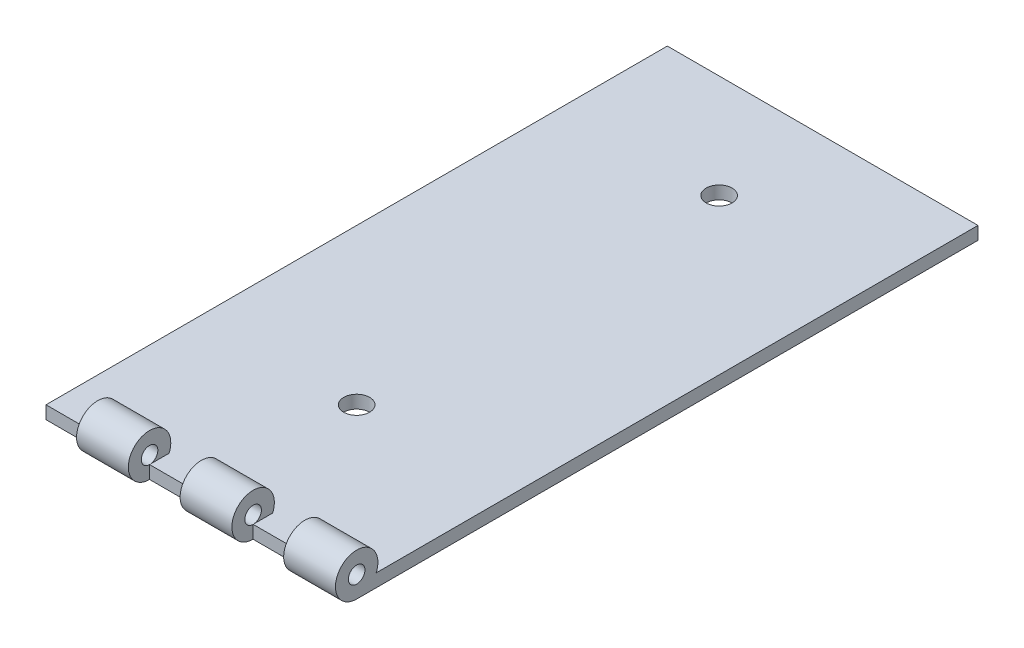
ISO-10303-21;
HEADER;
FILE_DESCRIPTION(('STEP AP214'),'2;1');
FILE_NAME('part.step','',(''),(''),'','','');
FILE_SCHEMA(('AUTOMOTIVE_DESIGN { 1 0 10303 214 1 1 1 1 }'));
ENDSEC;
DATA;
#1=APPLICATION_CONTEXT('core data for automotive mechanical design processes');
#2=APPLICATION_PROTOCOL_DEFINITION('international standard','automotive_design',2000,#1);
#3=PRODUCT_CONTEXT('',#1,'mechanical');
#4=PRODUCT('Part','Part','',(#3));
#5=PRODUCT_RELATED_PRODUCT_CATEGORY('part','',(#4));
#6=PRODUCT_DEFINITION_FORMATION('','',#4);
#7=PRODUCT_DEFINITION_CONTEXT('part definition',#1,'design');
#8=PRODUCT_DEFINITION('design','',#6,#7);
#9=PRODUCT_DEFINITION_SHAPE('','',#8);
#10=(LENGTH_UNIT() NAMED_UNIT(*) SI_UNIT(.MILLI.,.METRE.));
#11=(NAMED_UNIT(*) PLANE_ANGLE_UNIT() SI_UNIT($,.RADIAN.));
#12=(NAMED_UNIT(*) SI_UNIT($,.STERADIAN.) SOLID_ANGLE_UNIT());
#13=UNCERTAINTY_MEASURE_WITH_UNIT(LENGTH_MEASURE(1.E-05),#10,'distance_accuracy_value','');
#14=(GEOMETRIC_REPRESENTATION_CONTEXT(3) GLOBAL_UNCERTAINTY_ASSIGNED_CONTEXT((#13)) GLOBAL_UNIT_ASSIGNED_CONTEXT((#10,
#11,#12)) REPRESENTATION_CONTEXT('',''));
#15=CARTESIAN_POINT('',(0.,0.,0.));
#16=DIRECTION('',(0.,0.,1.));
#17=DIRECTION('',(1.,0.,0.));
#18=AXIS2_PLACEMENT_3D('',#15,#16,#17);
#19=CARTESIAN_POINT('',(-19.05,1.5875,38.1));
#20=DIRECTION('',(0.,0.,-1.));
#21=DIRECTION('',(-1.,0.,0.));
#22=AXIS2_PLACEMENT_3D('',#19,#20,#21);
#23=PLANE('',#22);
#24=DIRECTION('',(0.,-1.,0.));
#25=VECTOR('',#24,1.);
#26=CARTESIAN_POINT('',(-12.7,1.5875,38.1));
#27=LINE('',#26,#25);
#28=CARTESIAN_POINT('',(-12.7,1.5875,38.1));
#29=VERTEX_POINT('',#28);
#30=CARTESIAN_POINT('',(-12.7,0.,38.1));
#31=VERTEX_POINT('',#30);
#32=EDGE_CURVE('E161',#29,#31,#27,.T.);
#33=ORIENTED_EDGE('',*,*,#32,.F.);
#34=DIRECTION('',(1.,0.,0.));
#35=VECTOR('',#34,1.);
#36=CARTESIAN_POINT('',(-19.05,1.5875,38.1));
#37=LINE('',#36,#35);
#38=CARTESIAN_POINT('',(-19.05,1.5875,38.1));
#39=VERTEX_POINT('',#38);
#40=EDGE_CURVE('E217',#39,#29,#37,.T.);
#41=ORIENTED_EDGE('',*,*,#40,.F.);
#42=DIRECTION('',(0.,-1.,0.));
#43=VECTOR('',#42,1.);
#44=CARTESIAN_POINT('',(-19.05,1.5875,38.1));
#45=LINE('',#44,#43);
#46=CARTESIAN_POINT('',(-19.05,0.,38.1));
#47=VERTEX_POINT('',#46);
#48=EDGE_CURVE('E219',#39,#47,#45,.T.);
#49=ORIENTED_EDGE('',*,*,#48,.T.);
#50=DIRECTION('',(1.,0.,0.));
#51=VECTOR('',#50,1.);
#52=CARTESIAN_POINT('',(-19.05,0.,38.1));
#53=LINE('',#52,#51);
#54=EDGE_CURVE('E130',#47,#31,#53,.T.);
#55=ORIENTED_EDGE('',*,*,#54,.T.);
#56=EDGE_LOOP('',(#33,#41,#49,#55));
#57=FACE_BOUND('',#56,.T.);
#58=ADVANCED_FACE('F33',(#57),#23,.F.);
#59=CARTESIAN_POINT('',(0.,1.5875,0.));
#60=DIRECTION('',(0.,-1.,0.));
#61=DIRECTION('',(0.,0.,-1.));
#62=AXIS2_PLACEMENT_3D('',#59,#60,#61);
#63=PLANE('',#62);
#64=CARTESIAN_POINT('',(0.,1.5875,19.05));
#65=DIRECTION('',(0.,-1.,0.));
#66=DIRECTION('',(0.,0.,-1.));
#67=AXIS2_PLACEMENT_3D('',#64,#65,#66);
#68=CIRCLE('',#67,1.5875);
#69=CARTESIAN_POINT('',(0.,1.5875,20.6375));
#70=VERTEX_POINT('',#69);
#71=EDGE_CURVE('E462',#70,#70,#68,.T.);
#72=ORIENTED_EDGE('',*,*,#71,.T.);
#73=EDGE_LOOP('',(#72));
#74=FACE_BOUND('',#73,.T.);
#75=CARTESIAN_POINT('',(0.,1.5875,-25.4));
#76=DIRECTION('',(0.,-1.,0.));
#77=DIRECTION('',(0.,0.,-1.));
#78=AXIS2_PLACEMENT_3D('',#75,#76,#77);
#79=CIRCLE('',#78,1.5875);
#80=CARTESIAN_POINT('',(0.,1.5875,-23.8125));
#81=VERTEX_POINT('',#80);
#82=EDGE_CURVE('E466',#81,#81,#79,.T.);
#83=ORIENTED_EDGE('',*,*,#82,.T.);
#84=EDGE_LOOP('',(#83));
#85=FACE_BOUND('',#84,.T.);
#86=DIRECTION('',(0.,0.,1.));
#87=VECTOR('',#86,1.);
#88=CARTESIAN_POINT('',(-12.7,1.5875,0.));
#89=LINE('',#88,#87);
#90=CARTESIAN_POINT('',(-12.7,1.5875,35.7029275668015));
#91=VERTEX_POINT('',#90);
#92=EDGE_CURVE('E48',#91,#29,#89,.T.);
#93=ORIENTED_EDGE('',*,*,#92,.F.);
#94=DIRECTION('',(1.,0.,0.));
#95=VECTOR('',#94,1.);
#96=CARTESIAN_POINT('',(-12.7,1.5875,35.7029275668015));
#97=LINE('',#96,#95);
#98=CARTESIAN_POINT('',(-6.35,1.5875,35.7029275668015));
#99=VERTEX_POINT('',#98);
#100=EDGE_CURVE('E52',#91,#99,#97,.T.);
#101=ORIENTED_EDGE('',*,*,#100,.T.);
#102=DIRECTION('',(0.,0.,1.));
#103=VECTOR('',#102,1.);
#104=CARTESIAN_POINT('',(-6.35,1.5875,0.));
#105=LINE('',#104,#103);
#106=CARTESIAN_POINT('',(-6.35,1.5875,38.1));
#107=VERTEX_POINT('',#106);
#108=EDGE_CURVE('E140',#99,#107,#105,.T.);
#109=ORIENTED_EDGE('',*,*,#108,.T.);
#110=CARTESIAN_POINT('',(0.,1.5875,38.1));
#111=VERTEX_POINT('',#110);
#112=EDGE_CURVE('E135',#107,#111,#37,.T.);
#113=ORIENTED_EDGE('',*,*,#112,.T.);
#114=DIRECTION('',(0.,0.,1.));
#115=VECTOR('',#114,1.);
#116=CARTESIAN_POINT('',(0.,1.5875,0.));
#117=LINE('',#116,#115);
#118=CARTESIAN_POINT('',(0.,1.5875,35.7029275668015));
#119=VERTEX_POINT('',#118);
#120=EDGE_CURVE('E182',#119,#111,#117,.T.);
#121=ORIENTED_EDGE('',*,*,#120,.F.);
#122=DIRECTION('',(1.,0.,0.));
#123=VECTOR('',#122,1.);
#124=CARTESIAN_POINT('',(0.,1.5875,35.7029275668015));
#125=LINE('',#124,#123);
#126=CARTESIAN_POINT('',(6.35,1.5875,35.7029275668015));
#127=VERTEX_POINT('',#126);
#128=EDGE_CURVE('E187',#119,#127,#125,.T.);
#129=ORIENTED_EDGE('',*,*,#128,.T.);
#130=DIRECTION('',(0.,0.,1.));
#131=VECTOR('',#130,1.);
#132=CARTESIAN_POINT('',(6.35,1.5875,0.));
#133=LINE('',#132,#131);
#134=CARTESIAN_POINT('',(6.35,1.5875,38.1));
#135=VERTEX_POINT('',#134);
#136=EDGE_CURVE('E175',#127,#135,#133,.T.);
#137=ORIENTED_EDGE('',*,*,#136,.T.);
#138=CARTESIAN_POINT('',(12.7,1.5875,38.1));
#139=VERTEX_POINT('',#138);
#140=EDGE_CURVE('E216',#135,#139,#37,.T.);
#141=ORIENTED_EDGE('',*,*,#140,.T.);
#142=DIRECTION('',(0.,0.,1.));
#143=VECTOR('',#142,1.);
#144=CARTESIAN_POINT('',(12.7,1.5875,0.));
#145=LINE('',#144,#143);
#146=CARTESIAN_POINT('',(12.7,1.5875,35.7029275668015));
#147=VERTEX_POINT('',#146);
#148=EDGE_CURVE('E199',#147,#139,#145,.T.);
#149=ORIENTED_EDGE('',*,*,#148,.F.);
#150=DIRECTION('',(1.,0.,0.));
#151=VECTOR('',#150,1.);
#152=CARTESIAN_POINT('',(12.7,1.5875,35.7029275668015));
#153=LINE('',#152,#151);
#154=CARTESIAN_POINT('',(19.05,1.5875,35.7029275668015));
#155=VERTEX_POINT('',#154);
#156=EDGE_CURVE('E207',#147,#155,#153,.T.);
#157=ORIENTED_EDGE('',*,*,#156,.T.);
#158=DIRECTION('',(0.,0.,-1.));
#159=VECTOR('',#158,1.);
#160=CARTESIAN_POINT('',(19.05,1.5875,38.1));
#161=LINE('',#160,#159);
#162=CARTESIAN_POINT('',(19.05,1.5875,-38.1));
#163=VERTEX_POINT('',#162);
#164=EDGE_CURVE('E210',#155,#163,#161,.T.);
#165=ORIENTED_EDGE('',*,*,#164,.T.);
#166=DIRECTION('',(-1.,0.,0.));
#167=VECTOR('',#166,1.);
#168=CARTESIAN_POINT('',(-19.05,1.5875,-38.1));
#169=LINE('',#168,#167);
#170=CARTESIAN_POINT('',(-19.05,1.5875,-38.1));
#171=VERTEX_POINT('',#170);
#172=EDGE_CURVE('E212',#163,#171,#169,.T.);
#173=ORIENTED_EDGE('',*,*,#172,.T.);
#174=DIRECTION('',(0.,0.,1.));
#175=VECTOR('',#174,1.);
#176=CARTESIAN_POINT('',(-19.05,1.5875,38.1));
#177=LINE('',#176,#175);
#178=EDGE_CURVE('E214',#171,#39,#177,.T.);
#179=ORIENTED_EDGE('',*,*,#178,.T.);
#180=ORIENTED_EDGE('',*,*,#40,.T.);
#181=EDGE_LOOP('',(#93,#101,#109,#113,#121,#129,#137,#141,#149,#157,#165,#173,#179,#180));
#182=FACE_BOUND('',#181,.T.);
#183=ADVANCED_FACE('F258',(#74,#85,#182),#63,.F.);
#184=ORIENTED_EDGE('',*,*,#112,.F.);
#185=DIRECTION('',(0.,-1.,0.));
#186=VECTOR('',#185,1.);
#187=CARTESIAN_POINT('',(-6.35,1.5875,38.1));
#188=LINE('',#187,#186);
#189=CARTESIAN_POINT('',(-6.35,0.,38.1));
#190=VERTEX_POINT('',#189);
#191=EDGE_CURVE('E133',#107,#190,#188,.T.);
#192=ORIENTED_EDGE('',*,*,#191,.T.);
#193=CARTESIAN_POINT('',(0.,0.,38.1));
#194=VERTEX_POINT('',#193);
#195=EDGE_CURVE('E117',#190,#194,#53,.T.);
#196=ORIENTED_EDGE('',*,*,#195,.T.);
#197=DIRECTION('',(0.,-1.,0.));
#198=VECTOR('',#197,1.);
#199=CARTESIAN_POINT('',(0.,1.5875,38.1));
#200=LINE('',#199,#198);
#201=EDGE_CURVE('E185',#111,#194,#200,.T.);
#202=ORIENTED_EDGE('',*,*,#201,.F.);
#203=EDGE_LOOP('',(#184,#192,#196,#202));
#204=FACE_BOUND('',#203,.T.);
#205=ADVANCED_FACE('F134',(#204),#23,.F.);
#206=ORIENTED_EDGE('',*,*,#140,.F.);
#207=DIRECTION('',(0.,-1.,0.));
#208=VECTOR('',#207,1.);
#209=CARTESIAN_POINT('',(6.35,1.5875,38.1));
#210=LINE('',#209,#208);
#211=CARTESIAN_POINT('',(6.35,0.,38.1));
#212=VERTEX_POINT('',#211);
#213=EDGE_CURVE('E179',#135,#212,#210,.T.);
#214=ORIENTED_EDGE('',*,*,#213,.T.);
#215=CARTESIAN_POINT('',(12.7,0.,38.1));
#216=VERTEX_POINT('',#215);
#217=EDGE_CURVE('E149',#212,#216,#53,.T.);
#218=ORIENTED_EDGE('',*,*,#217,.T.);
#219=DIRECTION('',(0.,-1.,0.));
#220=VECTOR('',#219,1.);
#221=CARTESIAN_POINT('',(12.7,1.5875,38.1));
#222=LINE('',#221,#220);
#223=EDGE_CURVE('E204',#139,#216,#222,.T.);
#224=ORIENTED_EDGE('',*,*,#223,.F.);
#225=EDGE_LOOP('',(#206,#214,#218,#224));
#226=FACE_BOUND('',#225,.T.);
#227=ADVANCED_FACE('F260',(#226),#23,.F.);
#228=CARTESIAN_POINT('',(19.05,1.5875,38.1));
#229=DIRECTION('',(-1.,0.,0.));
#230=DIRECTION('',(0.,0.,1.));
#231=AXIS2_PLACEMENT_3D('',#228,#229,#230);
#232=PLANE('',#231);
#233=ORIENTED_EDGE('',*,*,#164,.F.);
#234=CARTESIAN_POINT('',(19.05,2.6035,38.1));
#235=DIRECTION('',(1.,0.,0.));
#236=DIRECTION('',(0.,0.,-1.));
#237=AXIS2_PLACEMENT_3D('',#234,#235,#236);
#238=CIRCLE('',#237,2.6035);
#239=CARTESIAN_POINT('',(19.05,0.,38.1));
#240=VERTEX_POINT('',#239);
#241=EDGE_CURVE('E193',#155,#240,#238,.T.);
#242=ORIENTED_EDGE('',*,*,#241,.T.);
#243=DIRECTION('',(0.,0.,-1.));
#244=VECTOR('',#243,1.);
#245=CARTESIAN_POINT('',(19.05,0.,38.1));
#246=LINE('',#245,#244);
#247=CARTESIAN_POINT('',(19.05,0.,-38.1));
#248=VERTEX_POINT('',#247);
#249=EDGE_CURVE('E209',#240,#248,#246,.T.);
#250=ORIENTED_EDGE('',*,*,#249,.T.);
#251=DIRECTION('',(0.,-1.,0.));
#252=VECTOR('',#251,1.);
#253=CARTESIAN_POINT('',(19.05,1.5875,-38.1));
#254=LINE('',#253,#252);
#255=EDGE_CURVE('E11',#163,#248,#254,.T.);
#256=ORIENTED_EDGE('',*,*,#255,.F.);
#257=EDGE_LOOP('',(#233,#242,#250,#256));
#258=FACE_BOUND('',#257,.T.);
#259=CARTESIAN_POINT('',(19.05,2.6035,38.1));
#260=DIRECTION('',(1.,0.,0.));
#261=DIRECTION('',(0.,0.,-1.));
#262=AXIS2_PLACEMENT_3D('',#259,#260,#261);
#263=CIRCLE('',#262,1.016);
#264=CARTESIAN_POINT('',(19.05,2.6035,37.084));
#265=VERTEX_POINT('',#264);
#266=EDGE_CURVE('E189',#265,#265,#263,.T.);
#267=ORIENTED_EDGE('',*,*,#266,.F.);
#268=EDGE_LOOP('',(#267));
#269=FACE_BOUND('',#268,.T.);
#270=ADVANCED_FACE('F35',(#258,#269),#232,.F.);
#271=CARTESIAN_POINT('',(-19.05,1.5875,-38.1));
#272=DIRECTION('',(0.,0.,1.));
#273=DIRECTION('',(1.,0.,0.));
#274=AXIS2_PLACEMENT_3D('',#271,#272,#273);
#275=PLANE('',#274);
#276=DIRECTION('',(-1.,0.,0.));
#277=VECTOR('',#276,1.);
#278=CARTESIAN_POINT('',(-19.05,0.,-38.1));
#279=LINE('',#278,#277);
#280=CARTESIAN_POINT('',(-19.05,0.,-38.1));
#281=VERTEX_POINT('',#280);
#282=EDGE_CURVE('E222',#248,#281,#279,.T.);
#283=ORIENTED_EDGE('',*,*,#282,.T.);
#284=DIRECTION('',(0.,-1.,0.));
#285=VECTOR('',#284,1.);
#286=CARTESIAN_POINT('',(-19.05,1.5875,-38.1));
#287=LINE('',#286,#285);
#288=EDGE_CURVE('E41',#171,#281,#287,.T.);
#289=ORIENTED_EDGE('',*,*,#288,.F.);
#290=ORIENTED_EDGE('',*,*,#172,.F.);
#291=ORIENTED_EDGE('',*,*,#255,.T.);
#292=EDGE_LOOP('',(#283,#289,#290,#291));
#293=FACE_BOUND('',#292,.T.);
#294=ADVANCED_FACE('F275',(#293),#275,.F.);
#295=CARTESIAN_POINT('',(-19.05,1.5875,38.1));
#296=DIRECTION('',(1.,0.,0.));
#297=DIRECTION('',(0.,0.,-1.));
#298=AXIS2_PLACEMENT_3D('',#295,#296,#297);
#299=PLANE('',#298);
#300=DIRECTION('',(0.,0.,1.));
#301=VECTOR('',#300,1.);
#302=CARTESIAN_POINT('',(-19.05,0.,38.1));
#303=LINE('',#302,#301);
#304=EDGE_CURVE('E224',#281,#47,#303,.T.);
#305=ORIENTED_EDGE('',*,*,#304,.T.);
#306=ORIENTED_EDGE('',*,*,#48,.F.);
#307=ORIENTED_EDGE('',*,*,#178,.F.);
#308=ORIENTED_EDGE('',*,*,#288,.T.);
#309=EDGE_LOOP('',(#305,#306,#307,#308));
#310=FACE_BOUND('',#309,.T.);
#311=ADVANCED_FACE('F233',(#310),#299,.F.);
#312=CARTESIAN_POINT('',(0.,0.,0.));
#313=DIRECTION('',(0.,-1.,0.));
#314=DIRECTION('',(0.,0.,-1.));
#315=AXIS2_PLACEMENT_3D('',#312,#313,#314);
#316=PLANE('',#315);
#317=CARTESIAN_POINT('',(0.,0.,19.05));
#318=DIRECTION('',(0.,1.,0.));
#319=DIRECTION('',(0.,0.,1.));
#320=AXIS2_PLACEMENT_3D('',#317,#318,#319);
#321=CIRCLE('',#320,1.5875);
#322=CARTESIAN_POINT('',(0.,0.,20.6375));
#323=VERTEX_POINT('',#322);
#324=EDGE_CURVE('E459',#323,#323,#321,.T.);
#325=ORIENTED_EDGE('',*,*,#324,.T.);
#326=EDGE_LOOP('',(#325));
#327=FACE_BOUND('',#326,.T.);
#328=CARTESIAN_POINT('',(0.,0.,-25.4));
#329=DIRECTION('',(0.,1.,0.));
#330=DIRECTION('',(0.,0.,1.));
#331=AXIS2_PLACEMENT_3D('',#328,#329,#330);
#332=CIRCLE('',#331,1.5875);
#333=CARTESIAN_POINT('',(0.,0.,-23.8125));
#334=VERTEX_POINT('',#333);
#335=EDGE_CURVE('E463',#334,#334,#332,.T.);
#336=ORIENTED_EDGE('',*,*,#335,.T.);
#337=EDGE_LOOP('',(#336));
#338=FACE_BOUND('',#337,.T.);
#339=ORIENTED_EDGE('',*,*,#249,.F.);
#340=EDGE_CURVE('E225',#216,#240,#53,.T.);
#341=ORIENTED_EDGE('',*,*,#340,.F.);
#342=ORIENTED_EDGE('',*,*,#217,.F.);
#343=EDGE_CURVE('E125',#194,#212,#53,.T.);
#344=ORIENTED_EDGE('',*,*,#343,.F.);
#345=ORIENTED_EDGE('',*,*,#195,.F.);
#346=EDGE_CURVE('E122',#31,#190,#53,.T.);
#347=ORIENTED_EDGE('',*,*,#346,.F.);
#348=ORIENTED_EDGE('',*,*,#54,.F.);
#349=ORIENTED_EDGE('',*,*,#304,.F.);
#350=ORIENTED_EDGE('',*,*,#282,.F.);
#351=EDGE_LOOP('',(#339,#341,#342,#344,#345,#347,#348,#349,#350));
#352=FACE_BOUND('',#351,.T.);
#353=ADVANCED_FACE('F119',(#327,#338,#352),#316,.T.);
#354=CARTESIAN_POINT('',(12.7,2.6035,38.1));
#355=DIRECTION('',(1.,0.,0.));
#356=DIRECTION('',(0.,0.,-1.));
#357=AXIS2_PLACEMENT_3D('',#354,#355,#356);
#358=CYLINDRICAL_SURFACE('',#357,2.6035);
#359=ORIENTED_EDGE('',*,*,#156,.F.);
#360=CARTESIAN_POINT('',(12.7,2.6035,38.1));
#361=DIRECTION('',(1.,0.,0.));
#362=DIRECTION('',(0.,0.,-1.));
#363=AXIS2_PLACEMENT_3D('',#360,#361,#362);
#364=CIRCLE('',#363,2.6035);
#365=EDGE_CURVE('E196',#147,#216,#364,.T.);
#366=ORIENTED_EDGE('',*,*,#365,.T.);
#367=ORIENTED_EDGE('',*,*,#340,.T.);
#368=ORIENTED_EDGE('',*,*,#241,.F.);
#369=EDGE_LOOP('',(#359,#366,#367,#368));
#370=FACE_BOUND('',#369,.T.);
#371=ADVANCED_FACE('F302',(#370),#358,.T.);
#372=CARTESIAN_POINT('',(12.7,2.6035,38.1));
#373=DIRECTION('',(1.,0.,0.));
#374=DIRECTION('',(0.,0.,-1.));
#375=AXIS2_PLACEMENT_3D('',#372,#373,#374);
#376=PLANE('',#375);
#377=CARTESIAN_POINT('',(12.7,2.6035,38.1));
#378=DIRECTION('',(1.,0.,0.));
#379=DIRECTION('',(0.,0.,-1.));
#380=AXIS2_PLACEMENT_3D('',#377,#378,#379);
#381=CIRCLE('',#380,1.016);
#382=EDGE_CURVE('E190',#139,#139,#381,.T.);
#383=ORIENTED_EDGE('',*,*,#382,.T.);
#384=ORIENTED_EDGE('',*,*,#223,.T.);
#385=ORIENTED_EDGE('',*,*,#365,.F.);
#386=ORIENTED_EDGE('',*,*,#148,.T.);
#387=EDGE_LOOP('',(#383,#384,#385,#386));
#388=FACE_BOUND('',#387,.T.);
#389=ADVANCED_FACE('F319',(#388),#376,.F.);
#390=CARTESIAN_POINT('',(12.7,2.6035,38.1));
#391=DIRECTION('',(1.,0.,0.));
#392=DIRECTION('',(0.,0.,-1.));
#393=AXIS2_PLACEMENT_3D('',#390,#391,#392);
#394=CYLINDRICAL_SURFACE('',#393,1.016);
#395=ORIENTED_EDGE('',*,*,#266,.T.);
#396=EDGE_LOOP('',(#395));
#397=FACE_BOUND('',#396,.T.);
#398=ORIENTED_EDGE('',*,*,#382,.F.);
#399=EDGE_LOOP('',(#398));
#400=FACE_BOUND('',#399,.T.);
#401=ADVANCED_FACE('F326',(#397,#400),#394,.F.);
#402=CARTESIAN_POINT('',(0.,2.6035,38.1));
#403=DIRECTION('',(1.,0.,0.));
#404=DIRECTION('',(0.,0.,-1.));
#405=AXIS2_PLACEMENT_3D('',#402,#403,#404);
#406=CYLINDRICAL_SURFACE('',#405,2.6035);
#407=ORIENTED_EDGE('',*,*,#128,.F.);
#408=CARTESIAN_POINT('',(0.,2.6035,38.1));
#409=DIRECTION('',(1.,0.,0.));
#410=DIRECTION('',(0.,0.,-1.));
#411=AXIS2_PLACEMENT_3D('',#408,#409,#410);
#412=CIRCLE('',#411,2.6035);
#413=EDGE_CURVE('E172',#119,#194,#412,.T.);
#414=ORIENTED_EDGE('',*,*,#413,.T.);
#415=ORIENTED_EDGE('',*,*,#343,.T.);
#416=CARTESIAN_POINT('',(6.35,2.6035,38.1));
#417=DIRECTION('',(1.,0.,0.));
#418=DIRECTION('',(0.,0.,-1.));
#419=AXIS2_PLACEMENT_3D('',#416,#417,#418);
#420=CIRCLE('',#419,2.6035);
#421=EDGE_CURVE('E169',#127,#212,#420,.T.);
#422=ORIENTED_EDGE('',*,*,#421,.F.);
#423=EDGE_LOOP('',(#407,#414,#415,#422));
#424=FACE_BOUND('',#423,.T.);
#425=ADVANCED_FACE('F296',(#424),#406,.T.);
#426=CARTESIAN_POINT('',(0.,2.6035,38.1));
#427=DIRECTION('',(1.,0.,0.));
#428=DIRECTION('',(0.,0.,-1.));
#429=AXIS2_PLACEMENT_3D('',#426,#427,#428);
#430=PLANE('',#429);
#431=CARTESIAN_POINT('',(0.,2.6035,38.1));
#432=DIRECTION('',(1.,0.,0.));
#433=DIRECTION('',(0.,0.,-1.));
#434=AXIS2_PLACEMENT_3D('',#431,#432,#433);
#435=CIRCLE('',#434,1.016);
#436=EDGE_CURVE('E166',#111,#111,#435,.T.);
#437=ORIENTED_EDGE('',*,*,#436,.T.);
#438=ORIENTED_EDGE('',*,*,#201,.T.);
#439=ORIENTED_EDGE('',*,*,#413,.F.);
#440=ORIENTED_EDGE('',*,*,#120,.T.);
#441=EDGE_LOOP('',(#437,#438,#439,#440));
#442=FACE_BOUND('',#441,.T.);
#443=ADVANCED_FACE('F292',(#442),#430,.F.);
#444=CARTESIAN_POINT('',(6.35,2.6035,38.1));
#445=DIRECTION('',(1.,0.,0.));
#446=DIRECTION('',(0.,0.,-1.));
#447=AXIS2_PLACEMENT_3D('',#444,#445,#446);
#448=PLANE('',#447);
#449=ORIENTED_EDGE('',*,*,#213,.F.);
#450=CARTESIAN_POINT('',(6.35,2.6035,38.1));
#451=DIRECTION('',(1.,0.,0.));
#452=DIRECTION('',(0.,0.,-1.));
#453=AXIS2_PLACEMENT_3D('',#450,#451,#452);
#454=CIRCLE('',#453,1.016);
#455=EDGE_CURVE('E165',#135,#135,#454,.T.);
#456=ORIENTED_EDGE('',*,*,#455,.F.);
#457=ORIENTED_EDGE('',*,*,#136,.F.);
#458=ORIENTED_EDGE('',*,*,#421,.T.);
#459=EDGE_LOOP('',(#449,#456,#457,#458));
#460=FACE_BOUND('',#459,.T.);
#461=ADVANCED_FACE('F282',(#460),#448,.T.);
#462=CARTESIAN_POINT('',(0.,2.6035,38.1));
#463=DIRECTION('',(1.,0.,0.));
#464=DIRECTION('',(0.,0.,-1.));
#465=AXIS2_PLACEMENT_3D('',#462,#463,#464);
#466=CYLINDRICAL_SURFACE('',#465,1.016);
#467=ORIENTED_EDGE('',*,*,#455,.T.);
#468=EDGE_LOOP('',(#467));
#469=FACE_BOUND('',#468,.T.);
#470=ORIENTED_EDGE('',*,*,#436,.F.);
#471=EDGE_LOOP('',(#470));
#472=FACE_BOUND('',#471,.T.);
#473=ADVANCED_FACE('F286',(#469,#472),#466,.F.);
#474=CARTESIAN_POINT('',(-12.7,2.6035,38.1));
#475=DIRECTION('',(1.,0.,0.));
#476=DIRECTION('',(0.,0.,-1.));
#477=AXIS2_PLACEMENT_3D('',#474,#475,#476);
#478=CYLINDRICAL_SURFACE('',#477,2.6035);
#479=ORIENTED_EDGE('',*,*,#100,.F.);
#480=CARTESIAN_POINT('',(-12.7,2.6035,38.1));
#481=DIRECTION('',(1.,0.,0.));
#482=DIRECTION('',(0.,0.,-1.));
#483=AXIS2_PLACEMENT_3D('',#480,#481,#482);
#484=CIRCLE('',#483,2.6035);
#485=EDGE_CURVE('E148',#91,#31,#484,.T.);
#486=ORIENTED_EDGE('',*,*,#485,.T.);
#487=ORIENTED_EDGE('',*,*,#346,.T.);
#488=CARTESIAN_POINT('',(-6.35,2.6035,38.1));
#489=DIRECTION('',(1.,0.,0.));
#490=DIRECTION('',(0.,0.,-1.));
#491=AXIS2_PLACEMENT_3D('',#488,#489,#490);
#492=CIRCLE('',#491,2.6035);
#493=EDGE_CURVE('E146',#99,#190,#492,.T.);
#494=ORIENTED_EDGE('',*,*,#493,.F.);
#495=EDGE_LOOP('',(#479,#486,#487,#494));
#496=FACE_BOUND('',#495,.T.);
#497=ADVANCED_FACE('F145',(#496),#478,.T.);
#498=CARTESIAN_POINT('',(-12.7,2.6035,38.1));
#499=DIRECTION('',(1.,0.,0.));
#500=DIRECTION('',(0.,0.,-1.));
#501=AXIS2_PLACEMENT_3D('',#498,#499,#500);
#502=PLANE('',#501);
#503=CARTESIAN_POINT('',(-12.7,2.6035,38.1));
#504=DIRECTION('',(1.,0.,0.));
#505=DIRECTION('',(0.,0.,-1.));
#506=AXIS2_PLACEMENT_3D('',#503,#504,#505);
#507=CIRCLE('',#506,1.016);
#508=EDGE_CURVE('E151',#29,#29,#507,.T.);
#509=ORIENTED_EDGE('',*,*,#508,.T.);
#510=ORIENTED_EDGE('',*,*,#32,.T.);
#511=ORIENTED_EDGE('',*,*,#485,.F.);
#512=ORIENTED_EDGE('',*,*,#92,.T.);
#513=EDGE_LOOP('',(#509,#510,#511,#512));
#514=FACE_BOUND('',#513,.T.);
#515=ADVANCED_FACE('F240',(#514),#502,.F.);
#516=CARTESIAN_POINT('',(-6.35,2.6035,38.1));
#517=DIRECTION('',(1.,0.,0.));
#518=DIRECTION('',(0.,0.,-1.));
#519=AXIS2_PLACEMENT_3D('',#516,#517,#518);
#520=PLANE('',#519);
#521=ORIENTED_EDGE('',*,*,#191,.F.);
#522=CARTESIAN_POINT('',(-6.35,2.6035,38.1));
#523=DIRECTION('',(1.,0.,0.));
#524=DIRECTION('',(0.,0.,-1.));
#525=AXIS2_PLACEMENT_3D('',#522,#523,#524);
#526=CIRCLE('',#525,1.016);
#527=EDGE_CURVE('E155',#107,#107,#526,.T.);
#528=ORIENTED_EDGE('',*,*,#527,.F.);
#529=ORIENTED_EDGE('',*,*,#108,.F.);
#530=ORIENTED_EDGE('',*,*,#493,.T.);
#531=EDGE_LOOP('',(#521,#528,#529,#530));
#532=FACE_BOUND('',#531,.T.);
#533=ADVANCED_FACE('F150',(#532),#520,.T.);
#534=CARTESIAN_POINT('',(-12.7,2.6035,38.1));
#535=DIRECTION('',(1.,0.,0.));
#536=DIRECTION('',(0.,0.,-1.));
#537=AXIS2_PLACEMENT_3D('',#534,#535,#536);
#538=CYLINDRICAL_SURFACE('',#537,1.016);
#539=ORIENTED_EDGE('',*,*,#527,.T.);
#540=EDGE_LOOP('',(#539));
#541=FACE_BOUND('',#540,.T.);
#542=ORIENTED_EDGE('',*,*,#508,.F.);
#543=EDGE_LOOP('',(#542));
#544=FACE_BOUND('',#543,.T.);
#545=ADVANCED_FACE('F243',(#541,#544),#538,.F.);
#546=CARTESIAN_POINT('',(0.,0.,-25.4));
#547=DIRECTION('',(0.,1.,0.));
#548=DIRECTION('',(0.,0.,1.));
#549=AXIS2_PLACEMENT_3D('',#546,#547,#548);
#550=CYLINDRICAL_SURFACE('',#549,1.5875);
#551=CARTESIAN_POINT('',(0.,0.,-23.8125));
#552=CARTESIAN_POINT('',(0.,0.0165364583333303,-23.8125));
#553=CARTESIAN_POINT('',(0.,0.0330729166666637,-23.8125));
#554=CARTESIAN_POINT('',(0.,0.0661458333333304,-23.8125));
#555=CARTESIAN_POINT('',(0.,0.0826822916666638,-23.8125));
#556=CARTESIAN_POINT('',(0.,0.115755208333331,-23.8125));
#557=CARTESIAN_POINT('',(0.,0.132291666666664,-23.8125));
#558=CARTESIAN_POINT('',(0.,0.165364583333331,-23.8125));
#559=CARTESIAN_POINT('',(0.,0.181901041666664,-23.8125));
#560=CARTESIAN_POINT('',(0.,0.214973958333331,-23.8125));
#561=CARTESIAN_POINT('',(0.,0.231510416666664,-23.8125));
#562=CARTESIAN_POINT('',(0.,0.264583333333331,-23.8125));
#563=CARTESIAN_POINT('',(0.,0.281119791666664,-23.8125));
#564=CARTESIAN_POINT('',(0.,0.314192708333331,-23.8125));
#565=CARTESIAN_POINT('',(0.,0.330729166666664,-23.8125));
#566=CARTESIAN_POINT('',(0.,0.363802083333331,-23.8125));
#567=CARTESIAN_POINT('',(0.,0.380338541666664,-23.8125));
#568=CARTESIAN_POINT('',(0.,0.413411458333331,-23.8125));
#569=CARTESIAN_POINT('',(0.,0.429947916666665,-23.8125));
#570=CARTESIAN_POINT('',(0.,0.463020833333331,-23.8125));
#571=CARTESIAN_POINT('',(0.,0.479557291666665,-23.8125));
#572=CARTESIAN_POINT('',(0.,0.512630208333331,-23.8125));
#573=CARTESIAN_POINT('',(0.,0.529166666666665,-23.8125));
#574=CARTESIAN_POINT('',(0.,0.562239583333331,-23.8125));
#575=CARTESIAN_POINT('',(0.,0.578776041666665,-23.8125));
#576=CARTESIAN_POINT('',(0.,0.611848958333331,-23.8125));
#577=CARTESIAN_POINT('',(0.,0.628385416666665,-23.8125));
#578=CARTESIAN_POINT('',(0.,0.661458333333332,-23.8125));
#579=CARTESIAN_POINT('',(0.,0.677994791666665,-23.8125));
#580=CARTESIAN_POINT('',(0.,0.711067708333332,-23.8125));
#581=CARTESIAN_POINT('',(0.,0.727604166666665,-23.8125));
#582=CARTESIAN_POINT('',(0.,0.760677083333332,-23.8125));
#583=CARTESIAN_POINT('',(0.,0.777213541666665,-23.8125));
#584=CARTESIAN_POINT('',(0.,0.810286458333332,-23.8125));
#585=CARTESIAN_POINT('',(0.,0.826822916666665,-23.8125));
#586=CARTESIAN_POINT('',(0.,0.859895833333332,-23.8125));
#587=CARTESIAN_POINT('',(0.,0.876432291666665,-23.8125));
#588=CARTESIAN_POINT('',(0.,0.909505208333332,-23.8125));
#589=CARTESIAN_POINT('',(0.,0.926041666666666,-23.8125));
#590=CARTESIAN_POINT('',(0.,0.959114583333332,-23.8125));
#591=CARTESIAN_POINT('',(0.,0.975651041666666,-23.8125));
#592=CARTESIAN_POINT('',(0.,1.00872395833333,-23.8125));
#593=CARTESIAN_POINT('',(0.,1.02526041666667,-23.8125));
#594=CARTESIAN_POINT('',(0.,1.05833333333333,-23.8125));
#595=CARTESIAN_POINT('',(0.,1.07486979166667,-23.8125));
#596=CARTESIAN_POINT('',(0.,1.10794270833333,-23.8125));
#597=CARTESIAN_POINT('',(0.,1.12447916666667,-23.8125));
#598=CARTESIAN_POINT('',(0.,1.15755208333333,-23.8125));
#599=CARTESIAN_POINT('',(0.,1.17408854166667,-23.8125));
#600=CARTESIAN_POINT('',(0.,1.20716145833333,-23.8125));
#601=CARTESIAN_POINT('',(0.,1.22369791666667,-23.8125));
#602=CARTESIAN_POINT('',(0.,1.25677083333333,-23.8125));
#603=CARTESIAN_POINT('',(0.,1.27330729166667,-23.8125));
#604=CARTESIAN_POINT('',(0.,1.30638020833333,-23.8125));
#605=CARTESIAN_POINT('',(0.,1.32291666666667,-23.8125));
#606=CARTESIAN_POINT('',(0.,1.35598958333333,-23.8125));
#607=CARTESIAN_POINT('',(0.,1.37252604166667,-23.8125));
#608=CARTESIAN_POINT('',(0.,1.40559895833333,-23.8125));
#609=CARTESIAN_POINT('',(0.,1.42213541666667,-23.8125));
#610=CARTESIAN_POINT('',(0.,1.45520833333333,-23.8125));
#611=CARTESIAN_POINT('',(0.,1.47174479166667,-23.8125));
#612=CARTESIAN_POINT('',(0.,1.50481770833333,-23.8125));
#613=CARTESIAN_POINT('',(0.,1.52135416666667,-23.8125));
#614=CARTESIAN_POINT('',(0.,1.55442708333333,-23.8125));
#615=CARTESIAN_POINT('',(0.,1.57096354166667,-23.8125));
#616=CARTESIAN_POINT('',(0.,1.5875,-23.8125));
#617=B_SPLINE_CURVE_WITH_KNOTS('',3,(#551,#552,#553,#554,#555,#556,#557,#558,#559,#560,#561,
#562,#563,#564,#565,#566,#567,#568,#569,#570,#571,#572,#573,#574,#575,#576,#577,#578,#579,#580,
#581,#582,#583,#584,#585,#586,#587,#588,#589,#590,#591,#592,#593,#594,#595,#596,#597,#598,#599,
#600,#601,#602,#603,#604,#605,#606,#607,#608,#609,#610,#611,#612,#613,#614,#615,#616),
.UNSPECIFIED.,.F.,.F.,(4,2,2,2,2,2,2,2,2,2,2,2,2,2,2,2,2,2,2,2,2,2,2,2,2,2,2,2,2,2,2,2,4),(0.,
0.0496093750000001,0.0992187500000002,0.148828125,0.1984375,0.248046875,0.297656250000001,
0.347265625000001,0.396875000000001,0.446484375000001,0.496093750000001,0.545703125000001,
0.595312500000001,0.644921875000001,0.694531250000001,0.744140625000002,0.793750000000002,
0.843359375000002,0.892968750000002,0.942578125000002,0.992187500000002,1.041796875,1.09140625,
1.141015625,1.190625,1.240234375,1.28984375,1.339453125,1.3890625,1.438671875,1.48828125,
1.537890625,1.5875),.UNSPECIFIED.);
#618=EDGE_CURVE('BSEAM245',#334,#81,#617,.T.);
#619=ORIENTED_EDGE('',*,*,#335,.F.);
#620=ORIENTED_EDGE('',*,*,#82,.F.);
#621=ORIENTED_EDGE('',*,*,#618,.T.);
#622=ORIENTED_EDGE('',*,*,#618,.F.);
#623=EDGE_LOOP('',(#619,#621,#620,#622));
#624=FACE_BOUND('',#623,.T.);
#625=ADVANCED_FACE('F245',(#624),#550,.F.);
#626=CARTESIAN_POINT('',(0.,0.,19.05));
#627=DIRECTION('',(0.,1.,0.));
#628=DIRECTION('',(0.,0.,1.));
#629=AXIS2_PLACEMENT_3D('',#626,#627,#628);
#630=CYLINDRICAL_SURFACE('',#629,1.5875);
#631=CARTESIAN_POINT('',(0.,0.,20.6375));
#632=CARTESIAN_POINT('',(0.,0.0165364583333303,20.6375));
#633=CARTESIAN_POINT('',(0.,0.0330729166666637,20.6375));
#634=CARTESIAN_POINT('',(0.,0.0661458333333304,20.6375));
#635=CARTESIAN_POINT('',(0.,0.0826822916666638,20.6375));
#636=CARTESIAN_POINT('',(0.,0.115755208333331,20.6375));
#637=CARTESIAN_POINT('',(0.,0.132291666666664,20.6375));
#638=CARTESIAN_POINT('',(0.,0.165364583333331,20.6375));
#639=CARTESIAN_POINT('',(0.,0.181901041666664,20.6375));
#640=CARTESIAN_POINT('',(0.,0.214973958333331,20.6375));
#641=CARTESIAN_POINT('',(0.,0.231510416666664,20.6375));
#642=CARTESIAN_POINT('',(0.,0.264583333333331,20.6375));
#643=CARTESIAN_POINT('',(0.,0.281119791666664,20.6375));
#644=CARTESIAN_POINT('',(0.,0.314192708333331,20.6375));
#645=CARTESIAN_POINT('',(0.,0.330729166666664,20.6375));
#646=CARTESIAN_POINT('',(0.,0.363802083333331,20.6375));
#647=CARTESIAN_POINT('',(0.,0.380338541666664,20.6375));
#648=CARTESIAN_POINT('',(0.,0.413411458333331,20.6375));
#649=CARTESIAN_POINT('',(0.,0.429947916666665,20.6375));
#650=CARTESIAN_POINT('',(0.,0.463020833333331,20.6375));
#651=CARTESIAN_POINT('',(0.,0.479557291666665,20.6375));
#652=CARTESIAN_POINT('',(0.,0.512630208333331,20.6375));
#653=CARTESIAN_POINT('',(0.,0.529166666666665,20.6375));
#654=CARTESIAN_POINT('',(0.,0.562239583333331,20.6375));
#655=CARTESIAN_POINT('',(0.,0.578776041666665,20.6375));
#656=CARTESIAN_POINT('',(0.,0.611848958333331,20.6375));
#657=CARTESIAN_POINT('',(0.,0.628385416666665,20.6375));
#658=CARTESIAN_POINT('',(0.,0.661458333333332,20.6375));
#659=CARTESIAN_POINT('',(0.,0.677994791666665,20.6375));
#660=CARTESIAN_POINT('',(0.,0.711067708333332,20.6375));
#661=CARTESIAN_POINT('',(0.,0.727604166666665,20.6375));
#662=CARTESIAN_POINT('',(0.,0.760677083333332,20.6375));
#663=CARTESIAN_POINT('',(0.,0.777213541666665,20.6375));
#664=CARTESIAN_POINT('',(0.,0.810286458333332,20.6375));
#665=CARTESIAN_POINT('',(0.,0.826822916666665,20.6375));
#666=CARTESIAN_POINT('',(0.,0.859895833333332,20.6375));
#667=CARTESIAN_POINT('',(0.,0.876432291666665,20.6375));
#668=CARTESIAN_POINT('',(0.,0.909505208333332,20.6375));
#669=CARTESIAN_POINT('',(0.,0.926041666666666,20.6375));
#670=CARTESIAN_POINT('',(0.,0.959114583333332,20.6375));
#671=CARTESIAN_POINT('',(0.,0.975651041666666,20.6375));
#672=CARTESIAN_POINT('',(0.,1.00872395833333,20.6375));
#673=CARTESIAN_POINT('',(0.,1.02526041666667,20.6375));
#674=CARTESIAN_POINT('',(0.,1.05833333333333,20.6375));
#675=CARTESIAN_POINT('',(0.,1.07486979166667,20.6375));
#676=CARTESIAN_POINT('',(0.,1.10794270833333,20.6375));
#677=CARTESIAN_POINT('',(0.,1.12447916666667,20.6375));
#678=CARTESIAN_POINT('',(0.,1.15755208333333,20.6375));
#679=CARTESIAN_POINT('',(0.,1.17408854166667,20.6375));
#680=CARTESIAN_POINT('',(0.,1.20716145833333,20.6375));
#681=CARTESIAN_POINT('',(0.,1.22369791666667,20.6375));
#682=CARTESIAN_POINT('',(0.,1.25677083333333,20.6375));
#683=CARTESIAN_POINT('',(0.,1.27330729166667,20.6375));
#684=CARTESIAN_POINT('',(0.,1.30638020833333,20.6375));
#685=CARTESIAN_POINT('',(0.,1.32291666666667,20.6375));
#686=CARTESIAN_POINT('',(0.,1.35598958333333,20.6375));
#687=CARTESIAN_POINT('',(0.,1.37252604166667,20.6375));
#688=CARTESIAN_POINT('',(0.,1.40559895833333,20.6375));
#689=CARTESIAN_POINT('',(0.,1.42213541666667,20.6375));
#690=CARTESIAN_POINT('',(0.,1.45520833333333,20.6375));
#691=CARTESIAN_POINT('',(0.,1.47174479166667,20.6375));
#692=CARTESIAN_POINT('',(0.,1.50481770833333,20.6375));
#693=CARTESIAN_POINT('',(0.,1.52135416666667,20.6375));
#694=CARTESIAN_POINT('',(0.,1.55442708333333,20.6375));
#695=CARTESIAN_POINT('',(0.,1.57096354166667,20.6375));
#696=CARTESIAN_POINT('',(0.,1.5875,20.6375));
#697=B_SPLINE_CURVE_WITH_KNOTS('',3,(#631,#632,#633,#634,#635,#636,#637,#638,#639,#640,#641,
#642,#643,#644,#645,#646,#647,#648,#649,#650,#651,#652,#653,#654,#655,#656,#657,#658,#659,#660,
#661,#662,#663,#664,#665,#666,#667,#668,#669,#670,#671,#672,#673,#674,#675,#676,#677,#678,#679,
#680,#681,#682,#683,#684,#685,#686,#687,#688,#689,#690,#691,#692,#693,#694,#695,#696),
.UNSPECIFIED.,.F.,.F.,(4,2,2,2,2,2,2,2,2,2,2,2,2,2,2,2,2,2,2,2,2,2,2,2,2,2,2,2,2,2,2,2,4),(0.,
0.0496093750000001,0.0992187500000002,0.148828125,0.1984375,0.248046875,0.297656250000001,
0.347265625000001,0.396875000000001,0.446484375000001,0.496093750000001,0.545703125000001,
0.595312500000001,0.644921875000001,0.694531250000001,0.744140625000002,0.793750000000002,
0.843359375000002,0.892968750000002,0.942578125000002,0.992187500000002,1.041796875,1.09140625,
1.141015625,1.190625,1.240234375,1.28984375,1.339453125,1.3890625,1.438671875,1.48828125,
1.537890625,1.5875),.UNSPECIFIED.);
#698=EDGE_CURVE('BSEAM252',#323,#70,#697,.T.);
#699=ORIENTED_EDGE('',*,*,#324,.F.);
#700=ORIENTED_EDGE('',*,*,#71,.F.);
#701=ORIENTED_EDGE('',*,*,#698,.T.);
#702=ORIENTED_EDGE('',*,*,#698,.F.);
#703=EDGE_LOOP('',(#699,#701,#700,#702));
#704=FACE_BOUND('',#703,.T.);
#705=ADVANCED_FACE('F252',(#704),#630,.F.);
#706=CLOSED_SHELL('',(#58,#183,#205,#227,#270,#294,#311,#353,#371,#389,#401,#425,#443,#461,#473,
#497,#515,#533,#545,#625,#705));
#707=MANIFOLD_SOLID_BREP('B2',#706);
#708=ADVANCED_BREP_SHAPE_REPRESENTATION('',(#18,#707),#14);
#709=SHAPE_DEFINITION_REPRESENTATION(#9,#708);
ENDSEC;
END-ISO-10303-21;
